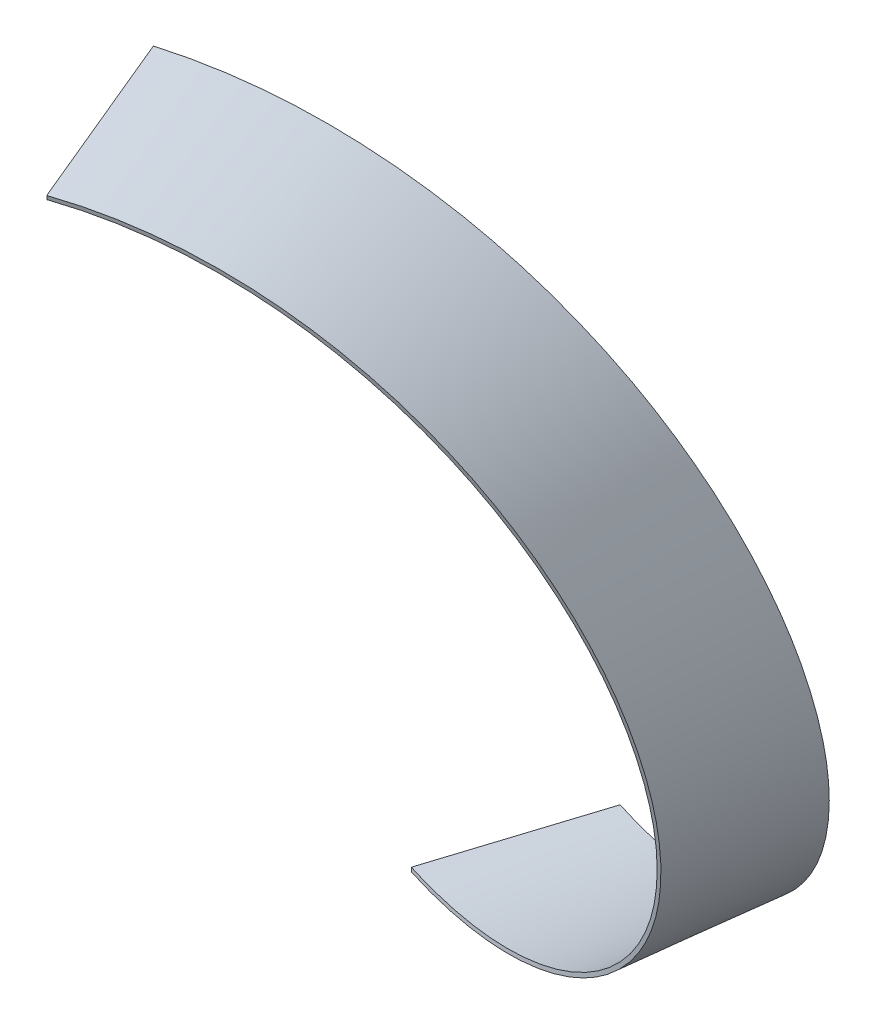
ISO-10303-21;
HEADER;
FILE_DESCRIPTION(('STEP AP214'),'2;1');
FILE_NAME('part.step','',(''),(''),'','','');
FILE_SCHEMA(('AUTOMOTIVE_DESIGN { 1 0 10303 214 1 1 1 1 }'));
ENDSEC;
DATA;
#1=APPLICATION_CONTEXT('core data for automotive mechanical design processes');
#2=APPLICATION_PROTOCOL_DEFINITION('international standard','automotive_design',2000,#1);
#3=PRODUCT_CONTEXT('',#1,'mechanical');
#4=PRODUCT('Part','Part','',(#3));
#5=PRODUCT_RELATED_PRODUCT_CATEGORY('part','',(#4));
#6=PRODUCT_DEFINITION_FORMATION('','',#4);
#7=PRODUCT_DEFINITION_CONTEXT('part definition',#1,'design');
#8=PRODUCT_DEFINITION('design','',#6,#7);
#9=PRODUCT_DEFINITION_SHAPE('','',#8);
#10=(LENGTH_UNIT() NAMED_UNIT(*) SI_UNIT(.MILLI.,.METRE.));
#11=(NAMED_UNIT(*) PLANE_ANGLE_UNIT() SI_UNIT($,.RADIAN.));
#12=(NAMED_UNIT(*) SI_UNIT($,.STERADIAN.) SOLID_ANGLE_UNIT());
#13=UNCERTAINTY_MEASURE_WITH_UNIT(LENGTH_MEASURE(1.E-05),#10,'distance_accuracy_value','');
#14=(GEOMETRIC_REPRESENTATION_CONTEXT(3) GLOBAL_UNCERTAINTY_ASSIGNED_CONTEXT((#13)) GLOBAL_UNIT_ASSIGNED_CONTEXT((#10,
#11,#12)) REPRESENTATION_CONTEXT('',''));
#15=CARTESIAN_POINT('',(0.,0.,0.));
#16=DIRECTION('',(0.,0.,1.));
#17=DIRECTION('',(1.,0.,0.));
#18=AXIS2_PLACEMENT_3D('',#15,#16,#17);
#19=CARTESIAN_POINT('',(-2.99485473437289,51.5839301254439,40.5913863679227));
#20=CARTESIAN_POINT('',(-0.998284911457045,50.5279767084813,46.8637954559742));
#21=CARTESIAN_POINT('',(0.998284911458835,49.4720232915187,53.1362045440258));
#22=CARTESIAN_POINT('',(2.99485473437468,48.4160698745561,59.4086136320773));
#23=CARTESIAN_POINT('',(-3.02248953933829,51.0902562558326,40.5170733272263));
#24=CARTESIAN_POINT('',(-1.02359311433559,50.0342845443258,46.7887387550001));
#25=CARTESIAN_POINT('',(0.975461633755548,48.9783289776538,53.060356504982));
#26=CARTESIAN_POINT('',(2.97471118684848,47.9223981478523,59.3319164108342));
#27=B_SPLINE_SURFACE_WITH_KNOTS('',1,3,((#19,#20,#21,#22),(#23,#24,#25,#26)),.UNSPECIFIED.,.F.,
.F.,.F.,(2,2),(4,4),(0.,1.),(-0.0099999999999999,0.0100000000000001),.UNSPECIFIED.);
#28=CARTESIAN_POINT('',(-3.02248953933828,51.0902562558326,40.5170733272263));
#29=CARTESIAN_POINT('',(-2.99485473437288,51.5839301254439,40.5913863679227));
#30=B_SPLINE_CURVE_WITH_KNOTS('',1,(#28,#29),.UNSPECIFIED.,.F.,.F.,(2,2),(0.,1.),.UNSPECIFIED.);
#31=CARTESIAN_POINT('',(-3.02248953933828,51.0902562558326,40.5170733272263));
#32=VERTEX_POINT('',#31);
#33=CARTESIAN_POINT('',(-2.99485473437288,51.5839301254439,40.5913863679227));
#34=VERTEX_POINT('',#33);
#35=EDGE_CURVE('E13',#32,#34,#30,.T.);
#36=CARTESIAN_POINT('',(-3.02248953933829,51.0902562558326,40.5170733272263));
#37=CARTESIAN_POINT('',(-1.02359311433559,50.0342845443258,46.7887387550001));
#38=CARTESIAN_POINT('',(0.975461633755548,48.9783289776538,53.060356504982));
#39=CARTESIAN_POINT('',(2.97471118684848,47.9223981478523,59.3319164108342));
#40=B_SPLINE_CURVE_WITH_KNOTS('',3,(#36,#37,#38,#39),.UNSPECIFIED.,.F.,.F.,(4,4),
(-0.0099999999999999,0.0100000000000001),.UNSPECIFIED.);
#41=CARTESIAN_POINT('',(2.97471118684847,47.9223981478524,59.3319164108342));
#42=VERTEX_POINT('',#41);
#43=EDGE_CURVE('E121',#32,#42,#40,.T.);
#44=CARTESIAN_POINT('',(2.97471118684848,47.9223981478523,59.3319164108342));
#45=CARTESIAN_POINT('',(2.99485473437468,48.4160698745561,59.4086136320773));
#46=B_SPLINE_CURVE_WITH_KNOTS('',1,(#44,#45),.UNSPECIFIED.,.F.,.F.,(2,2),(0.,1.),.UNSPECIFIED.);
#47=CARTESIAN_POINT('',(2.99485473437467,48.4160698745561,59.4086136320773));
#48=VERTEX_POINT('',#47);
#49=EDGE_CURVE('E69',#42,#48,#46,.T.);
#50=CARTESIAN_POINT('',(-2.99485473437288,51.5839301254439,40.5913863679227));
#51=CARTESIAN_POINT('',(-2.74528350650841,51.4519359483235,41.3754375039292));
#52=CARTESIAN_POINT('',(-2.24614105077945,51.1879475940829,42.943539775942));
#53=CARTESIAN_POINT('',(-1.49742736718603,50.7919650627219,45.2956931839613));
#54=CARTESIAN_POINT('',(-0.7487136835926,50.395982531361,47.6478465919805));
#55=CARTESIAN_POINT('',(-0.249571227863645,50.1319941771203,49.2159488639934));
#56=CARTESIAN_POINT('',(0.249571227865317,49.8680058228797,50.7840511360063));
#57=CARTESIAN_POINT('',(0.748713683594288,49.604017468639,52.3521534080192));
#58=CARTESIAN_POINT('',(1.49742736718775,49.2080349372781,54.7043068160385));
#59=CARTESIAN_POINT('',(2.24614105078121,48.8120524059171,57.0564602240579));
#60=CARTESIAN_POINT('',(2.74528350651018,48.5480640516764,58.6245624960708));
#61=CARTESIAN_POINT('',(2.99485473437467,48.4160698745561,59.4086136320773));
#62=B_SPLINE_CURVE_WITH_KNOTS('',3,(#50,#51,#52,#53,#54,#55,#56,#57,#58,#59,#60,#61),
.UNSPECIFIED.,.F.,.F.,(4,1,1,1,2,1,1,1,4),(0.,0.124999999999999,0.249999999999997,
0.374999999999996,0.499999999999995,0.624999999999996,0.749999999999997,0.874999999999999,1.),.UNSPECIFIED.);
#63=EDGE_CURVE('E256',#34,#48,#62,.T.);
#64=ORIENTED_EDGE('',*,*,#35,.F.);
#65=ORIENTED_EDGE('',*,*,#43,.T.);
#66=ORIENTED_EDGE('',*,*,#49,.T.);
#67=ORIENTED_EDGE('',*,*,#63,.F.);
#68=EDGE_LOOP('',(#64,#65,#66,#67));
#69=FACE_BOUND('',#68,.T.);
#70=ADVANCED_FACE('F55',(#69),#27,.T.);
#71=CARTESIAN_POINT('',(-3.03314471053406,-50.,9.52890513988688));
#72=CARTESIAN_POINT('',(0.360160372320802,-50.0329985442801,10.5665472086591));
#73=CARTESIAN_POINT('',(3.76168133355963,-49.7436873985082,11.6068194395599));
#74=CARTESIAN_POINT('',(10.434161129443,-48.5290174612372,13.6863320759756));
#75=CARTESIAN_POINT('',(13.7051199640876,-47.6036586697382,14.7255724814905));
#76=CARTESIAN_POINT('',(20.0015327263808,-45.1642616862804,16.8036620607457));
#77=CARTESIAN_POINT('',(23.0269866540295,-43.6502234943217,17.842511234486));
#78=CARTESIAN_POINT('',(28.7174468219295,-40.0808359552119,19.9204589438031));
#79=CARTESIAN_POINT('',(31.3824530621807,-38.0254866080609,20.95955747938));
#80=CARTESIAN_POINT('',(36.2615354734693,-33.4635190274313,23.0378630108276));
#81=CARTESIAN_POINT('',(38.4756116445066,-30.9569007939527,24.0770700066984));
#82=CARTESIAN_POINT('',(42.3623515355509,-25.582437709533,26.1554515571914));
#83=CARTESIAN_POINT('',(44.0350152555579,-22.7145928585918,27.1946261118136));
#84=CARTESIAN_POINT('',(46.7905429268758,-16.7346203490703,29.2729597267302));
#85=CARTESIAN_POINT('',(47.8734068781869,-13.62249269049,30.3121187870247));
#86=CARTESIAN_POINT('',(49.4009476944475,-7.2708983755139,32.3904383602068));
#87=CARTESIAN_POINT('',(49.8456245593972,-4.03143171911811,33.4295988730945));
#88=CARTESIAN_POINT('',(50.096791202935,2.44750159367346,35.5079198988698));
#89=CARTESIAN_POINT('',(49.9032809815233,5.68696825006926,36.5470804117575));
#90=CARTESIAN_POINT('',(48.8780734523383,12.0385625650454,38.6253999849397));
#91=CARTESIAN_POINT('',(48.0463761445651,15.1506902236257,39.6645590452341));
#92=CARTESIAN_POINT('',(45.7931817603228,21.1306627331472,41.7428926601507));
#93=CARTESIAN_POINT('',(44.3716846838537,23.9985075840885,42.7820672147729));
#94=CARTESIAN_POINT('',(40.9872780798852,29.3729706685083,44.8604487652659));
#95=CARTESIAN_POINT('',(39.0243685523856,31.8795889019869,45.8996557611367));
#96=CARTESIAN_POINT('',(34.6476194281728,36.4415564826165,47.9779612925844));
#97=CARTESIAN_POINT('',(32.2337798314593,38.4969058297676,49.0170598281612));
#98=CARTESIAN_POINT('',(27.0456529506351,42.0662933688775,51.0950075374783));
#99=CARTESIAN_POINT('',(24.2713656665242,43.5803315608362,52.1338567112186));
#100=CARTESIAN_POINT('',(18.4772861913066,46.0197285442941,54.2119462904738));
#101=CARTESIAN_POINT('',(15.4574940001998,46.9450873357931,55.2511866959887));
#102=CARTESIAN_POINT('',(9.2873474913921,48.1597572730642,57.3306993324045));
#103=CARTESIAN_POINT('',(6.13699317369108,48.4490684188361,58.3709715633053));
#104=CARTESIAN_POINT('',(2.99485473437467,48.4160698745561,59.4086136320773));
#105=CARTESIAN_POINT('',(-3.02871389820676,-49.5000216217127,9.53031551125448));
#106=CARTESIAN_POINT('',(0.335269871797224,-49.5327387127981,10.5602976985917));
#107=CARTESIAN_POINT('',(3.70743367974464,-49.2458565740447,11.5940511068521));
#108=CARTESIAN_POINT('',(10.3204846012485,-48.0417282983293,13.6624933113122));
#109=CARTESIAN_POINT('',(13.5623574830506,-47.1243215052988,14.6974619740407));
#110=CARTESIAN_POINT('',(19.8017633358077,-44.7061782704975,16.769206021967));
#111=CARTESIAN_POINT('',(22.7992750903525,-43.2054480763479,17.8059793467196));
#112=CARTESIAN_POINT('',(28.4351749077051,-39.668730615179,19.8816766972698));
#113=CARTESIAN_POINT('',(31.0745586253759,-37.6321358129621,20.9208172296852));
#114=CARTESIAN_POINT('',(35.9057853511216,-33.1126518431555,23.0010023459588));
#115=CARTESIAN_POINT('',(38.0976110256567,-30.6297789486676,24.0420482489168));
#116=CARTESIAN_POINT('',(41.9438862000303,-25.3083907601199,26.1253729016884));
#117=CARTESIAN_POINT('',(43.5990790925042,-22.4688943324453,27.1677888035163));
#118=CARTESIAN_POINT('',(46.3254660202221,-16.5490148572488,29.2534042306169));
#119=CARTESIAN_POINT('',(47.3966516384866,-13.4686514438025,30.2966054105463));
#120=CARTESIAN_POINT('',(48.9074121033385,-7.18388651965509,32.3830282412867));
#121=CARTESIAN_POINT('',(49.3472931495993,-3.97825952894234,33.4263450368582));
#122=CARTESIAN_POINT('',(49.59585922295,2.43268650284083,35.5123614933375));
#123=CARTESIAN_POINT('',(49.4045401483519,5.63798406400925,36.5550625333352));
#124=CARTESIAN_POINT('',(48.3909587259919,11.9213487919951,38.6390292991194));
#125=CARTESIAN_POINT('',(47.5684846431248,15.0006704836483,39.6804150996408));
#126=CARTESIAN_POINT('',(45.3398447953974,20.917868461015,41.7613809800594));
#127=CARTESIAN_POINT('',(43.933683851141,23.7557192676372,42.8009622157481));
#128=CARTESIAN_POINT('',(40.5860028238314,29.0732586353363,44.8777341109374));
#129=CARTESIAN_POINT('',(38.6437950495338,31.5540142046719,45.9151260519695));
#130=CARTESIAN_POINT('',(34.3125202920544,36.0691416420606,47.9874565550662));
#131=CARTESIAN_POINT('',(31.9234719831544,38.1034926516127,49.0223929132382));
#132=CARTESIAN_POINT('',(26.7890665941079,41.6359160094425,51.0893417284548));
#133=CARTESIAN_POINT('',(24.0427032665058,43.1346855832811,52.1216462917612));
#134=CARTESIAN_POINT('',(18.3061931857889,45.5496085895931,54.1845540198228));
#135=CARTESIAN_POINT('',(15.3160692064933,46.4657556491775,55.2151513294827));
#136=CARTESIAN_POINT('',(9.20686183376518,47.6683143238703,57.2753434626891));
#137=CARTESIAN_POINT('',(6.0867201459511,47.9549182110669,58.3052672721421));
#138=CARTESIAN_POINT('',(2.97471118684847,47.9223981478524,59.3319164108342));
#139=B_SPLINE_SURFACE_WITH_KNOTS('',1,3,((#71,#72,#73,#74,#75,#76,#77,#78,#79,#80,#81,#82,#83,
#84,#85,#86,#87,#88,#89,#90,#91,#92,#93,#94,#95,#96,#97,#98,#99,#100,#101,#102,#103,#104),(#105,
#106,#107,#108,#109,#110,#111,#112,#113,#114,#115,#116,#117,#118,#119,#120,#121,#122,#123,#124,
#125,#126,#127,#128,#129,#130,#131,#132,#133,#134,#135,#136,#137,#138)),.UNSPECIFIED.,.F.,.F.,
.F.,(2,2),(4,2,2,2,2,2,2,2,2,2,2,2,2,2,2,2,4),(0.,1.),(0.,0.0625,0.125,0.1875,0.25,0.3125,0.375,
0.4375,0.5,0.5625,0.625,0.6875,0.75,0.8125,0.875,0.9375,1.),.UNSPECIFIED.);
#140=CARTESIAN_POINT('',(2.97471118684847,47.9223981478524,59.3319164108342));
#141=CARTESIAN_POINT('',(6.0867201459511,47.9549182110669,58.3052672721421));
#142=CARTESIAN_POINT('',(9.20686183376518,47.6683143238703,57.2753434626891));
#143=CARTESIAN_POINT('',(15.3160692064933,46.4657556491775,55.2151513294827));
#144=CARTESIAN_POINT('',(18.3061931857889,45.5496085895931,54.1845540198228));
#145=CARTESIAN_POINT('',(24.0427032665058,43.1346855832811,52.1216462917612));
#146=CARTESIAN_POINT('',(26.7890665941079,41.6359160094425,51.0893417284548));
#147=CARTESIAN_POINT('',(31.9234719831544,38.1034926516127,49.0223929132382));
#148=CARTESIAN_POINT('',(34.3125202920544,36.0691416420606,47.9874565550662));
#149=CARTESIAN_POINT('',(38.6437950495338,31.5540142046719,45.9151260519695));
#150=CARTESIAN_POINT('',(40.5860028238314,29.0732586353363,44.8777341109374));
#151=CARTESIAN_POINT('',(43.933683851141,23.7557192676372,42.8009622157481));
#152=CARTESIAN_POINT('',(45.3398447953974,20.917868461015,41.7613809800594));
#153=CARTESIAN_POINT('',(47.5684846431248,15.0006704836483,39.6804150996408));
#154=CARTESIAN_POINT('',(48.3909587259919,11.9213487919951,38.6390292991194));
#155=CARTESIAN_POINT('',(49.4045401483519,5.63798406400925,36.5550625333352));
#156=CARTESIAN_POINT('',(49.59585922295,2.43268650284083,35.5123614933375));
#157=CARTESIAN_POINT('',(49.3472931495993,-3.97825952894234,33.4263450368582));
#158=CARTESIAN_POINT('',(48.9074121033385,-7.18388651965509,32.3830282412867));
#159=CARTESIAN_POINT('',(47.3966516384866,-13.4686514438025,30.2966054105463));
#160=CARTESIAN_POINT('',(46.3254660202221,-16.5490148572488,29.2534042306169));
#161=CARTESIAN_POINT('',(43.5990790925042,-22.4688943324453,27.1677888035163));
#162=CARTESIAN_POINT('',(41.9438862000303,-25.3083907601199,26.1253729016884));
#163=CARTESIAN_POINT('',(38.0976110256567,-30.6297789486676,24.0420482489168));
#164=CARTESIAN_POINT('',(35.9057853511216,-33.1126518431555,23.0010023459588));
#165=CARTESIAN_POINT('',(31.0745586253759,-37.6321358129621,20.9208172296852));
#166=CARTESIAN_POINT('',(28.4351749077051,-39.668730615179,19.8816766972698));
#167=CARTESIAN_POINT('',(22.7992750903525,-43.2054480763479,17.8059793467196));
#168=CARTESIAN_POINT('',(19.8017633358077,-44.7061782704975,16.769206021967));
#169=CARTESIAN_POINT('',(13.5623574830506,-47.1243215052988,14.6974619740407));
#170=CARTESIAN_POINT('',(10.3204846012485,-48.0417282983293,13.6624933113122));
#171=CARTESIAN_POINT('',(3.70743367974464,-49.2458565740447,11.5940511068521));
#172=CARTESIAN_POINT('',(0.335269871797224,-49.5327387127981,10.5602976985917));
#173=CARTESIAN_POINT('',(-3.02871389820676,-49.5000216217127,9.53031551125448));
#174=B_SPLINE_CURVE_WITH_KNOTS('',3,(#140,#141,#142,#143,#144,#145,#146,#147,#148,#149,#150,
#151,#152,#153,#154,#155,#156,#157,#158,#159,#160,#161,#162,#163,#164,#165,#166,#167,#168,#169,
#170,#171,#172,#173),.UNSPECIFIED.,.F.,.F.,(4,2,2,2,2,2,2,2,2,2,2,2,2,2,2,2,4),(0.,0.0625,0.125,
0.1875,0.25,0.3125,0.375,0.4375,0.5,0.5625,0.625,0.6875,0.75,0.8125,0.875,0.9375,1.),.UNSPECIFIED.);
#175=CARTESIAN_POINT('',(-3.02871389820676,-49.5000216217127,9.53031551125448));
#176=VERTEX_POINT('',#175);
#177=EDGE_CURVE('E289',#42,#176,#174,.T.);
#178=CARTESIAN_POINT('',(-3.02871389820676,-49.5000216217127,9.53031551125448));
#179=CARTESIAN_POINT('',(-3.03314471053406,-50.,9.52890513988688));
#180=B_SPLINE_CURVE_WITH_KNOTS('',1,(#178,#179),.UNSPECIFIED.,.F.,.F.,(2,2),(0.,1.),.UNSPECIFIED.);
#181=CARTESIAN_POINT('',(-3.03314471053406,-50.,9.52890513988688));
#182=VERTEX_POINT('',#181);
#183=EDGE_CURVE('E111',#176,#182,#180,.T.);
#184=CARTESIAN_POINT('',(2.99485473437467,48.4160698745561,59.4086136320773));
#185=CARTESIAN_POINT('',(6.13699317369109,48.4490684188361,58.3709715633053));
#186=CARTESIAN_POINT('',(15.5880561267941,47.5811349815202,55.2501548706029));
#187=CARTESIAN_POINT('',(30.3606117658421,41.3642219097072,50.0565324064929));
#188=CARTESIAN_POINT('',(43.7623062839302,27.4081923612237,43.8211931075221));
#189=CARTESIAN_POINT('',(50.6670513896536,9.11744340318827,37.586243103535));
#190=CARTESIAN_POINT('',(49.91355145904,-10.7013735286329,31.3512756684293));
#191=CARTESIAN_POINT('',(41.5018064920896,-28.9921224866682,25.1163256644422));
#192=CARTESIAN_POINT('',(26.5931121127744,-42.9481520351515,18.8809863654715));
#193=CARTESIAN_POINT('',(10.5647232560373,-49.1650651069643,13.6873639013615));
#194=CARTESIAN_POINT('',(0.360160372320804,-50.0329985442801,10.5665472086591));
#195=CARTESIAN_POINT('',(-3.03314471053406,-50.,9.52890513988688));
#196=B_SPLINE_CURVE_WITH_KNOTS('',3,(#184,#185,#186,#187,#188,#189,#190,#191,#192,#193,#194,
#195),.UNSPECIFIED.,.F.,.F.,(4,1,1,1,1,1,1,1,1,4),(0.,0.0625,0.1875,0.3125,0.4375,0.5625,0.6875,
0.8125,0.9375,1.),.UNSPECIFIED.);
#197=EDGE_CURVE('E129',#48,#182,#196,.T.);
#198=ORIENTED_EDGE('',*,*,#49,.F.);
#199=ORIENTED_EDGE('',*,*,#177,.T.);
#200=ORIENTED_EDGE('',*,*,#183,.T.);
#201=ORIENTED_EDGE('',*,*,#197,.F.);
#202=EDGE_LOOP('',(#198,#199,#200,#201));
#203=FACE_BOUND('',#202,.T.);
#204=ADVANCED_FACE('F152',(#203),#139,.F.);
#205=CARTESIAN_POINT('',(-3.03314471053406,-49.9999999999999,9.52890513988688));
#206=CARTESIAN_POINT('',(-1.01104823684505,-50.,3.17630171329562));
#207=CARTESIAN_POINT('',(1.01104823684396,-50.,-3.17630171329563));
#208=CARTESIAN_POINT('',(3.03314471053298,-50.0000000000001,-9.52890513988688));
#209=CARTESIAN_POINT('',(-3.02871389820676,-49.5000216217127,9.53031551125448));
#210=CARTESIAN_POINT('',(-1.0094720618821,-49.4999937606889,3.17680342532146));
#211=CARTESIAN_POINT('',(1.0095786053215,-49.4999905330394,-3.17676951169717));
#212=CARTESIAN_POINT('',(3.02839562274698,-49.5000248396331,-9.53041682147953));
#213=B_SPLINE_SURFACE_WITH_KNOTS('',1,3,((#205,#206,#207,#208),(#209,#210,#211,#212)),
.UNSPECIFIED.,.F.,.F.,.F.,(2,2),(4,4),(0.,1.),(-0.0099999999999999,0.0100000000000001),.UNSPECIFIED.);
#214=CARTESIAN_POINT('',(-3.02871389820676,-49.5000216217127,9.53031551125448));
#215=CARTESIAN_POINT('',(-1.0094720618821,-49.4999937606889,3.17680342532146));
#216=CARTESIAN_POINT('',(1.0095786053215,-49.4999905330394,-3.17676951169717));
#217=CARTESIAN_POINT('',(3.02839562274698,-49.5000248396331,-9.53041682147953));
#218=B_SPLINE_CURVE_WITH_KNOTS('',3,(#214,#215,#216,#217),.UNSPECIFIED.,.F.,.F.,(4,4),
(-0.0099999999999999,0.0100000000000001),.UNSPECIFIED.);
#219=CARTESIAN_POINT('',(3.02839562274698,-49.5000248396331,-9.53041682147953));
#220=VERTEX_POINT('',#219);
#221=EDGE_CURVE('E119',#176,#220,#218,.T.);
#222=CARTESIAN_POINT('',(3.02839562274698,-49.5000248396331,-9.53041682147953));
#223=CARTESIAN_POINT('',(3.03314471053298,-50.0000000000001,-9.52890513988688));
#224=B_SPLINE_CURVE_WITH_KNOTS('',1,(#222,#223),.UNSPECIFIED.,.F.,.F.,(2,2),(0.,1.),.UNSPECIFIED.);
#225=CARTESIAN_POINT('',(3.03314471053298,-50.,-9.52890513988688));
#226=VERTEX_POINT('',#225);
#227=EDGE_CURVE('E99',#220,#226,#224,.T.);
#228=CARTESIAN_POINT('',(-3.03314471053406,-50.,9.52890513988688));
#229=CARTESIAN_POINT('',(-2.78038265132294,-50.,8.73482971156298));
#230=CARTESIAN_POINT('',(-2.27485853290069,-49.9999999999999,7.14667885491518));
#231=CARTESIAN_POINT('',(-1.51657235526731,-50.0000000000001,4.76445256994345));
#232=CARTESIAN_POINT('',(-0.758286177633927,-50.,2.38222628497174));
#233=CARTESIAN_POINT('',(-0.25276205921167,-50.,0.794075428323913));
#234=CARTESIAN_POINT('',(0.252762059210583,-50.,-0.794075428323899));
#235=CARTESIAN_POINT('',(0.758286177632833,-50.,-2.3822262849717));
#236=CARTESIAN_POINT('',(1.51657235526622,-50.,-4.76445256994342));
#237=CARTESIAN_POINT('',(2.2748585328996,-50.,-7.14667885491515));
#238=CARTESIAN_POINT('',(2.78038265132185,-50.,-8.73482971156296));
#239=CARTESIAN_POINT('',(3.03314471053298,-50.,-9.52890513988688));
#240=B_SPLINE_CURVE_WITH_KNOTS('',3,(#228,#229,#230,#231,#232,#233,#234,#235,#236,#237,#238,
#239),.UNSPECIFIED.,.F.,.F.,(4,1,1,1,2,1,1,1,4),(0.,0.125000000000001,0.250000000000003,
0.375000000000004,0.500000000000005,0.625000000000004,0.750000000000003,0.875000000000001,1.),.UNSPECIFIED.);
#241=EDGE_CURVE('E112',#182,#226,#240,.T.);
#242=ORIENTED_EDGE('',*,*,#183,.F.);
#243=ORIENTED_EDGE('',*,*,#221,.T.);
#244=ORIENTED_EDGE('',*,*,#227,.T.);
#245=ORIENTED_EDGE('',*,*,#241,.F.);
#246=EDGE_LOOP('',(#242,#243,#244,#245));
#247=FACE_BOUND('',#246,.T.);
#248=ADVANCED_FACE('F126',(#247),#213,.T.);
#249=CARTESIAN_POINT('',(3.03314471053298,-50.,-9.52890513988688));
#250=CARTESIAN_POINT('',(6.17528314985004,-49.96700145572,-8.48625092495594));
#251=CARTESIAN_POINT('',(9.32563746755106,-49.6116932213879,-7.44096654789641));
#252=CARTESIAN_POINT('',(15.4957839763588,-48.2650291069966,-5.35142961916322));
#253=CARTESIAN_POINT('',(18.5155761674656,-47.2736732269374,-4.30717706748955));
#254=CARTESIAN_POINT('',(24.3096556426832,-44.7022820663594,-2.21906319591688));
#255=CARTESIAN_POINT('',(27.0839429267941,-43.1222467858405,-1.17520187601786));
#256=CARTESIAN_POINT('',(32.2720698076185,-39.4208650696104,0.912770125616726));
#257=CARTESIAN_POINT('',(34.6859094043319,-37.2995186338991,1.9568808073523));
#258=CARTESIAN_POINT('',(39.0626585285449,-32.6055568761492,4.04521063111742));
#259=CARTESIAN_POINT('',(41.0255680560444,-30.0329415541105,5.08942977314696));
#260=CARTESIAN_POINT('',(44.4099746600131,-24.5264842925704,7.1778356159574));
#261=CARTESIAN_POINT('',(45.8314717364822,-21.5926423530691,8.2220223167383));
#262=CARTESIAN_POINT('',(48.0846661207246,-15.4806756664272,10.3103802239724));
#263=CARTESIAN_POINT('',(48.9163634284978,-12.3025509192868,11.3545514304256));
#264=CARTESIAN_POINT('',(49.9415709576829,-5.81896242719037,13.4428952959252));
#265=CARTESIAN_POINT('',(50.1350811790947,-2.51349868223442,14.4870679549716));
#266=CARTESIAN_POINT('',(49.883914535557,4.09742880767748,16.5754132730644));
#267=CARTESIAN_POINT('',(49.4392376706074,7.40289255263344,17.6195859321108));
#268=CARTESIAN_POINT('',(47.9116968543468,13.8864810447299,19.7079297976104));
#269=CARTESIAN_POINT('',(46.8288329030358,17.0646057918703,20.7521010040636));
#270=CARTESIAN_POINT('',(44.0733052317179,23.1765724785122,22.8404589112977));
#271=CARTESIAN_POINT('',(42.400641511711,26.1104144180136,23.8846456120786));
#272=CARTESIAN_POINT('',(38.5139016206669,31.6168716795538,25.9730514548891));
#273=CARTESIAN_POINT('',(36.2998254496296,34.1894870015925,27.0172705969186));
#274=CARTESIAN_POINT('',(31.4207430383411,38.8834487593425,29.1056004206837));
#275=CARTESIAN_POINT('',(28.7557367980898,41.0047951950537,30.1497111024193));
#276=CARTESIAN_POINT('',(23.0652766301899,44.7061769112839,32.2376831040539));
#277=CARTESIAN_POINT('',(20.0398227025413,46.2862121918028,33.2815444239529));
#278=CARTESIAN_POINT('',(13.743409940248,48.857603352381,35.3696582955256));
#279=CARTESIAN_POINT('',(10.4724511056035,49.8489592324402,36.4139108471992));
#280=CARTESIAN_POINT('',(3.79997130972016,51.1956233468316,38.5034477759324));
#281=CARTESIAN_POINT('',(0.398450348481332,51.5509315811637,39.548732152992));
#282=CARTESIAN_POINT('',(-2.99485473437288,51.5839301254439,40.5913863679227));
#283=CARTESIAN_POINT('',(3.02839562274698,-49.5000248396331,-9.53041682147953));
#284=CARTESIAN_POINT('',(6.13908528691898,-49.4673498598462,-8.49597942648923));
#285=CARTESIAN_POINT('',(9.25803643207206,-49.115478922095,-7.45766651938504));
#286=CARTESIAN_POINT('',(15.3649928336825,-47.7821621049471,-5.37989987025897));
#287=CARTESIAN_POINT('',(18.3540660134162,-46.8005067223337,-4.34014310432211));
#288=CARTESIAN_POINT('',(24.0885391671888,-44.2543956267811,-2.25861154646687));
#289=CARTESIAN_POINT('',(26.8339153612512,-42.6899511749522,-1.21683917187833));
#290=CARTESIAN_POINT('',(31.9664418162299,-39.0261446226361,0.869018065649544));
#291=CARTESIAN_POINT('',(34.354600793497,-36.9260833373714,1.91332341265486));
#292=CARTESIAN_POINT('',(38.6843274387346,-32.279556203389,4.00391037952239));
#293=CARTESIAN_POINT('',(40.6258802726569,-29.7331118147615,5.05019338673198));
#294=CARTESIAN_POINT('',(43.9725989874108,-24.2841126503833,7.14398005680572));
#295=CARTESIAN_POINT('',(45.3784531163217,-21.3804884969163,8.19161704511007));
#296=CARTESIAN_POINT('',(47.6067784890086,-15.3314676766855,10.2875767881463));
#297=CARTESIAN_POINT('',(48.429244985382,-12.1860917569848,11.3359010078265));
#298=CARTESIAN_POINT('',(49.4428679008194,-5.77016685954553,13.4324451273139));
#299=CARTESIAN_POINT('',(49.6342254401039,-2.49837726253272,14.4807570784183));
#300=CARTESIAN_POINT('',(49.3854446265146,4.04593952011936,16.5766618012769));
#301=CARTESIAN_POINT('',(48.9453059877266,7.31844538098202,17.6242563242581));
#302=CARTESIAN_POINT('',(47.4334529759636,13.7371382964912,19.7179886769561));
#303=CARTESIAN_POINT('',(46.3614456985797,16.8845157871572,20.764245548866));
#304=CARTESIAN_POINT('',(43.6328338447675,22.9382373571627,22.8550200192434));
#305=CARTESIAN_POINT('',(41.9762379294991,25.8445598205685,23.8995389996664));
#306=CARTESIAN_POINT('',(38.1267184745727,31.2991748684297,25.9863491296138));
#307=CARTESIAN_POINT('',(35.9330975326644,33.8484345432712,27.0288327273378));
#308=CARTESIAN_POINT('',(31.0981739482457,38.5002337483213,29.111538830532));
#309=CARTESIAN_POINT('',(28.4568889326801,40.6027583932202,30.1517596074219));
#310=CARTESIAN_POINT('',(22.8172985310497,44.2709898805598,32.2295011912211));
#311=CARTESIAN_POINT('',(19.8180397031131,45.8373204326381,33.2672943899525));
#312=CARTESIAN_POINT('',(13.5753889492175,48.3865821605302,35.3413288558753));
#313=CARTESIAN_POINT('',(10.3320157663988,49.3695090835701,36.3775653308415));
#314=CARTESIAN_POINT('',(3.71618003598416,50.7047639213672,38.4491193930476));
#315=CARTESIAN_POINT('',(0.342735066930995,51.0572755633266,39.4847428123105));
#316=CARTESIAN_POINT('',(-3.02248953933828,51.0902562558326,40.5170733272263));
#317=B_SPLINE_SURFACE_WITH_KNOTS('',1,3,((#249,#250,#251,#252,#253,#254,#255,#256,#257,#258,
#259,#260,#261,#262,#263,#264,#265,#266,#267,#268,#269,#270,#271,#272,#273,#274,#275,#276,#277,
#278,#279,#280,#281,#282),(#283,#284,#285,#286,#287,#288,#289,#290,#291,#292,#293,#294,#295,
#296,#297,#298,#299,#300,#301,#302,#303,#304,#305,#306,#307,#308,#309,#310,#311,#312,#313,#314,
#315,#316)),.UNSPECIFIED.,.F.,.F.,.F.,(2,2),(4,2,2,2,2,2,2,2,2,2,2,2,2,2,2,2,4),(0.,1.),(0.,
0.0625,0.125,0.1875,0.25,0.3125,0.375,0.4375,0.5,0.5625,0.625,0.6875,0.75,0.8125,0.875,0.9375,
1.),.UNSPECIFIED.);
#318=CARTESIAN_POINT('',(3.02839562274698,-49.5000248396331,-9.53041682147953));
#319=CARTESIAN_POINT('',(6.13908528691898,-49.4673498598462,-8.49597942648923));
#320=CARTESIAN_POINT('',(9.25803643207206,-49.115478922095,-7.45766651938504));
#321=CARTESIAN_POINT('',(15.3649928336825,-47.7821621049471,-5.37989987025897));
#322=CARTESIAN_POINT('',(18.3540660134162,-46.8005067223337,-4.34014310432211));
#323=CARTESIAN_POINT('',(24.0885391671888,-44.2543956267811,-2.25861154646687));
#324=CARTESIAN_POINT('',(26.8339153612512,-42.6899511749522,-1.21683917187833));
#325=CARTESIAN_POINT('',(31.9664418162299,-39.0261446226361,0.869018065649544));
#326=CARTESIAN_POINT('',(34.354600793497,-36.9260833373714,1.91332341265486));
#327=CARTESIAN_POINT('',(38.6843274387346,-32.279556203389,4.00391037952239));
#328=CARTESIAN_POINT('',(40.6258802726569,-29.7331118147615,5.05019338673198));
#329=CARTESIAN_POINT('',(43.9725989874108,-24.2841126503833,7.14398005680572));
#330=CARTESIAN_POINT('',(45.3784531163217,-21.3804884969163,8.19161704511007));
#331=CARTESIAN_POINT('',(47.6067784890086,-15.3314676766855,10.2875767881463));
#332=CARTESIAN_POINT('',(48.429244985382,-12.1860917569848,11.3359010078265));
#333=CARTESIAN_POINT('',(49.4428679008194,-5.77016685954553,13.4324451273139));
#334=CARTESIAN_POINT('',(49.6342254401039,-2.49837726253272,14.4807570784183));
#335=CARTESIAN_POINT('',(49.3854446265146,4.04593952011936,16.5766618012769));
#336=CARTESIAN_POINT('',(48.9453059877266,7.31844538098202,17.6242563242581));
#337=CARTESIAN_POINT('',(47.4334529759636,13.7371382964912,19.7179886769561));
#338=CARTESIAN_POINT('',(46.3614456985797,16.8845157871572,20.764245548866));
#339=CARTESIAN_POINT('',(43.6328338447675,22.9382373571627,22.8550200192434));
#340=CARTESIAN_POINT('',(41.9762379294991,25.8445598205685,23.8995389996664));
#341=CARTESIAN_POINT('',(38.1267184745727,31.2991748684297,25.9863491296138));
#342=CARTESIAN_POINT('',(35.9330975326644,33.8484345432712,27.0288327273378));
#343=CARTESIAN_POINT('',(31.0981739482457,38.5002337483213,29.111538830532));
#344=CARTESIAN_POINT('',(28.4568889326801,40.6027583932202,30.1517596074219));
#345=CARTESIAN_POINT('',(22.8172985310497,44.2709898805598,32.2295011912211));
#346=CARTESIAN_POINT('',(19.8180397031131,45.8373204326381,33.2672943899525));
#347=CARTESIAN_POINT('',(13.5753889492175,48.3865821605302,35.3413288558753));
#348=CARTESIAN_POINT('',(10.3320157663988,49.3695090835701,36.3775653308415));
#349=CARTESIAN_POINT('',(3.71618003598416,50.7047639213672,38.4491193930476));
#350=CARTESIAN_POINT('',(0.342735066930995,51.0572755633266,39.4847428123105));
#351=CARTESIAN_POINT('',(-3.02248953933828,51.0902562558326,40.5170733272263));
#352=B_SPLINE_CURVE_WITH_KNOTS('',3,(#318,#319,#320,#321,#322,#323,#324,#325,#326,#327,#328,
#329,#330,#331,#332,#333,#334,#335,#336,#337,#338,#339,#340,#341,#342,#343,#344,#345,#346,#347,
#348,#349,#350,#351),.UNSPECIFIED.,.F.,.F.,(4,2,2,2,2,2,2,2,2,2,2,2,2,2,2,2,4),(0.,0.0625,0.125,
0.1875,0.25,0.3125,0.375,0.4375,0.5,0.5625,0.625,0.6875,0.75,0.8125,0.875,0.9375,1.),.UNSPECIFIED.);
#353=EDGE_CURVE('E101',#220,#32,#352,.T.);
#354=CARTESIAN_POINT('',(3.03314471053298,-50.,-9.52890513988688));
#355=CARTESIAN_POINT('',(6.17528314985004,-49.96700145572,-8.48625092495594));
#356=CARTESIAN_POINT('',(15.6263461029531,-48.9010767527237,-5.35039779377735));
#357=CARTESIAN_POINT('',(30.3989017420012,-42.3541782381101,-0.131714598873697));
#358=CARTESIAN_POINT('',(43.8005962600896,-28.0021661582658,6.13369757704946));
#359=CARTESIAN_POINT('',(50.7053413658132,-9.31543466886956,12.3987204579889));
#360=CARTESIAN_POINT('',(49.9518414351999,10.8993647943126,18.6637607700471));
#361=CARTESIAN_POINT('',(41.5400964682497,29.586096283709,24.9287836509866));
#362=CARTESIAN_POINT('',(26.6314020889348,43.9381083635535,31.1941958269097));
#363=CARTESIAN_POINT('',(10.6030132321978,50.4850068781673,36.4128790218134));
#364=CARTESIAN_POINT('',(0.398450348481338,51.5509315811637,39.548732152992));
#365=CARTESIAN_POINT('',(-2.99485473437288,51.5839301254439,40.5913863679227));
#366=B_SPLINE_CURVE_WITH_KNOTS('',3,(#354,#355,#356,#357,#358,#359,#360,#361,#362,#363,#364,
#365),.UNSPECIFIED.,.F.,.F.,(4,1,1,1,1,1,1,1,1,4),(0.,0.0625,0.1875,0.3125,0.4375,0.5625,0.6875,
0.8125,0.9375,1.),.UNSPECIFIED.);
#367=EDGE_CURVE('E104',#226,#34,#366,.T.);
#368=ORIENTED_EDGE('',*,*,#353,.T.);
#369=ORIENTED_EDGE('',*,*,#35,.T.);
#370=ORIENTED_EDGE('',*,*,#367,.F.);
#371=ORIENTED_EDGE('',*,*,#227,.F.);
#372=EDGE_LOOP('',(#368,#369,#370,#371));
#373=FACE_BOUND('',#372,.T.);
#374=ADVANCED_FACE('F57',(#373),#317,.T.);
#375=CARTESIAN_POINT('',(-3.03314471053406,-50.,9.52890513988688));
#376=CARTESIAN_POINT('',(0.360160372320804,-50.0329985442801,10.5665472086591));
#377=CARTESIAN_POINT('',(10.5647232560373,-49.1650651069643,13.6873639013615));
#378=CARTESIAN_POINT('',(26.5931121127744,-42.9481520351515,18.8809863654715));
#379=CARTESIAN_POINT('',(41.5018064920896,-28.9921224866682,25.1163256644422));
#380=CARTESIAN_POINT('',(49.91355145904,-10.7013735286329,31.3512756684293));
#381=CARTESIAN_POINT('',(50.6670513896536,9.11744340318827,37.586243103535));
#382=CARTESIAN_POINT('',(43.7623062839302,27.4081923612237,43.8211931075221));
#383=CARTESIAN_POINT('',(30.3606117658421,41.3642219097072,50.0565324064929));
#384=CARTESIAN_POINT('',(15.5880561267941,47.5811349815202,55.2501548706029));
#385=CARTESIAN_POINT('',(6.13699317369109,48.4490684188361,58.3709715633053));
#386=CARTESIAN_POINT('',(2.99485473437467,48.4160698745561,59.4086136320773));
#387=CARTESIAN_POINT('',(-2.78038265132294,-50.,8.73482971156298));
#388=CARTESIAN_POINT('',(0.602457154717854,-50.0302486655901,9.77268061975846));
#389=CARTESIAN_POINT('',(10.7756242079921,-49.1540655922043,12.8941238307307));
#390=CARTESIAN_POINT('',(26.7516866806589,-42.9234031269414,18.0887904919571));
#391=CARTESIAN_POINT('',(41.5975893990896,-28.9508743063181,24.3253828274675));
#392=CARTESIAN_POINT('',(49.9465427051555,-10.6436260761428,30.5615858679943));
#393=CARTESIAN_POINT('',(50.6372509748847,9.19169012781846,36.7978063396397));
#394=CARTESIAN_POINT('',(43.6697142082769,27.4989383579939,43.0340093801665));
#395=CARTESIAN_POINT('',(30.2052280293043,41.4714671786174,49.2706017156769));
#396=CARTESIAN_POINT('',(15.3803460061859,47.7021296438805,54.4652683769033));
#397=CARTESIAN_POINT('',(5.89788722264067,48.5783127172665,57.5867115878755));
#398=CARTESIAN_POINT('',(2.74528350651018,48.5480640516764,58.6245624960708));
#399=CARTESIAN_POINT('',(-2.27485853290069,-49.9999999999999,7.14667885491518));
#400=CARTESIAN_POINT('',(1.08705071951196,-50.02474890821,8.18494744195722));
#401=CARTESIAN_POINT('',(11.1974261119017,-49.1320665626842,11.3076436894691));
#402=CARTESIAN_POINT('',(27.0688358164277,-42.8739053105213,16.5043987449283));
#403=CARTESIAN_POINT('',(41.7891552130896,-28.8683779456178,22.7434971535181));
#404=CARTESIAN_POINT('',(50.0125251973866,-10.5281311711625,28.9822062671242));
#405=CARTESIAN_POINT('',(50.5776501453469,9.34018357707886,35.220932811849));
#406=CARTESIAN_POINT('',(43.4845300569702,27.6804303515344,41.4596419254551));
#407=CARTESIAN_POINT('',(29.8944605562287,41.685957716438,47.698740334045));
#408=CARTESIAN_POINT('',(14.9649257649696,47.9441189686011,52.8954953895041));
#409=CARTESIAN_POINT('',(5.41967532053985,48.8368013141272,56.0181916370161));
#410=CARTESIAN_POINT('',(2.24614105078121,48.8120524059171,57.0564602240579));
#411=CARTESIAN_POINT('',(-1.51657235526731,-50.0000000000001,4.76445256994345));
#412=CARTESIAN_POINT('',(1.81394106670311,-50.0164992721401,5.80334767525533));
#413=CARTESIAN_POINT('',(11.8301289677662,-49.0990680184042,8.92792347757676));
#414=CARTESIAN_POINT('',(27.5445595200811,-42.7996585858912,14.1278111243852));
#415=CARTESIAN_POINT('',(42.0765039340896,-28.7446334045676,20.370668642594));
#416=CARTESIAN_POINT('',(50.1114989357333,-10.3548888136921,26.6131368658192));
#417=CARTESIAN_POINT('',(50.4882489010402,9.56292375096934,32.855622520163));
#418=CARTESIAN_POINT('',(43.2067538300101,27.952668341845,39.0980907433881));
#419=CARTESIAN_POINT('',(29.4283093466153,42.0076935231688,45.340948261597));
#420=CARTESIAN_POINT('',(14.341795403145,48.307102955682,50.5408359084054));
#421=CARTESIAN_POINT('',(4.70235746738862,49.2245342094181,53.6654117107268));
#422=CARTESIAN_POINT('',(1.49742736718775,49.2080349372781,54.7043068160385));
#423=CARTESIAN_POINT('',(-0.758286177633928,-50.,2.38222628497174));
#424=CARTESIAN_POINT('',(2.54083141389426,-50.00824963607,3.42174790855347));
#425=CARTESIAN_POINT('',(12.4628318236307,-49.066069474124,6.54820326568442));
#426=CARTESIAN_POINT('',(28.0202832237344,-42.7254118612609,11.751223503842));
#427=CARTESIAN_POINT('',(42.3638526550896,-28.6208888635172,17.9978401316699));
#428=CARTESIAN_POINT('',(50.2104726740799,-10.1816464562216,24.2440674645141));
#429=CARTESIAN_POINT('',(50.3988476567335,9.78566392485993,30.490312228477));
#430=CARTESIAN_POINT('',(42.92897760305,28.2249063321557,36.7365395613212));
#431=CARTESIAN_POINT('',(28.9621581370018,42.3294293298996,42.9831561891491));
#432=CARTESIAN_POINT('',(13.7186650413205,48.6700869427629,48.1861764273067));
#433=CARTESIAN_POINT('',(3.98503961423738,49.612267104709,51.3126317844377));
#434=CARTESIAN_POINT('',(0.748713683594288,49.604017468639,52.3521534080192));
#435=CARTESIAN_POINT('',(-0.252762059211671,-50.,0.794075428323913));
#436=CARTESIAN_POINT('',(3.02542497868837,-50.0027498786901,1.8340147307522));
#437=CARTESIAN_POINT('',(12.8846337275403,-49.044070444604,4.96172312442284));
#438=CARTESIAN_POINT('',(28.3374323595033,-42.6759140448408,10.1668317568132));
#439=CARTESIAN_POINT('',(42.5554184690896,-28.5383925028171,16.4159544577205));
#440=CARTESIAN_POINT('',(50.276455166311,-10.0661515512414,22.6646878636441));
#441=CARTESIAN_POINT('',(50.3392468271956,9.93415737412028,28.9134387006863));
#442=CARTESIAN_POINT('',(42.7437934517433,28.4063983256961,35.1621721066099));
#443=CARTESIAN_POINT('',(28.6513906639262,42.5439198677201,41.4112948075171));
#444=CARTESIAN_POINT('',(13.3032448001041,48.9120762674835,46.6164034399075));
#445=CARTESIAN_POINT('',(3.50682771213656,49.8707557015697,49.7441118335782));
#446=CARTESIAN_POINT('',(0.249571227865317,49.8680058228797,50.7840511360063));
#447=CARTESIAN_POINT('',(0.252762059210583,-50.,-0.7940754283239));
#448=CARTESIAN_POINT('',(3.51001854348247,-49.99725012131,0.246281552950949));
#449=CARTESIAN_POINT('',(13.30643563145,-49.0220714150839,3.37524298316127));
#450=CARTESIAN_POINT('',(28.6545814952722,-42.6264162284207,8.58244000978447));
#451=CARTESIAN_POINT('',(42.7469842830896,-28.4558961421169,14.8340687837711));
#452=CARTESIAN_POINT('',(50.3424376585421,-9.95065664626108,21.085308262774));
#453=CARTESIAN_POINT('',(50.2796459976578,10.0826508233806,27.3365651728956));
#454=CARTESIAN_POINT('',(42.5586093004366,28.5878903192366,33.5878046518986));
#455=CARTESIAN_POINT('',(28.3406231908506,42.7584104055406,39.8394334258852));
#456=CARTESIAN_POINT('',(12.8878245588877,49.1540655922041,45.0466304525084));
#457=CARTESIAN_POINT('',(3.02861581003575,50.1292442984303,48.1755918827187));
#458=CARTESIAN_POINT('',(-0.249571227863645,50.1319941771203,49.2159488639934));
#459=CARTESIAN_POINT('',(0.758286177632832,-50.,-2.3822262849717));
#460=CARTESIAN_POINT('',(3.99461210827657,-49.9917503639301,-1.34145162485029));
#461=CARTESIAN_POINT('',(13.7282375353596,-49.0000723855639,1.78876284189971));
#462=CARTESIAN_POINT('',(28.9717306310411,-42.5769184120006,6.99804826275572));
#463=CARTESIAN_POINT('',(42.9385500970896,-28.3733997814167,13.2521831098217));
#464=CARTESIAN_POINT('',(50.4084201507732,-9.83516174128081,19.505928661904));
#465=CARTESIAN_POINT('',(50.22004516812,10.231144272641,25.759691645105));
#466=CARTESIAN_POINT('',(42.3734251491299,28.769382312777,32.0134371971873));
#467=CARTESIAN_POINT('',(28.029855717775,42.9729009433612,38.2675720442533));
#468=CARTESIAN_POINT('',(12.4724043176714,49.3960549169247,43.4768574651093));
#469=CARTESIAN_POINT('',(2.55040390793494,50.387732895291,46.6070719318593));
#470=CARTESIAN_POINT('',(-0.7487136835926,50.395982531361,47.6478465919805));
#471=CARTESIAN_POINT('',(1.51657235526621,-50.,-4.76445256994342));
#472=CARTESIAN_POINT('',(4.72150245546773,-49.98350072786,-3.72305139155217));
#473=CARTESIAN_POINT('',(14.3609403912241,-48.9670738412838,-0.590957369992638));
#474=CARTESIAN_POINT('',(29.4474543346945,-42.5026716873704,4.62146064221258));
#475=CARTESIAN_POINT('',(43.2258988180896,-28.2496552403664,10.8793545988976));
#476=CARTESIAN_POINT('',(50.5073938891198,-9.66191938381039,17.136859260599));
#477=CARTESIAN_POINT('',(50.1306439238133,10.4538844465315,23.394381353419));
#478=CARTESIAN_POINT('',(42.0956489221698,29.0416203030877,29.6518860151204));
#479=CARTESIAN_POINT('',(27.5637045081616,43.2946367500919,35.9097799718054));
#480=CARTESIAN_POINT('',(11.8492739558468,49.7590389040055,41.1221979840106));
#481=CARTESIAN_POINT('',(1.83308605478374,50.7754657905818,44.2542920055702));
#482=CARTESIAN_POINT('',(-1.49742736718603,50.7919650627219,45.2956931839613));
#483=CARTESIAN_POINT('',(2.2748585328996,-50.,-7.14667885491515));
#484=CARTESIAN_POINT('',(5.44839280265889,-49.97525109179,-6.10465115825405));
#485=CARTESIAN_POINT('',(14.9936432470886,-48.9340752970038,-2.97067758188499));
#486=CARTESIAN_POINT('',(29.9231780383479,-42.4284249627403,2.24487302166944));
#487=CARTESIAN_POINT('',(43.5132475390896,-28.1259106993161,8.50652608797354));
#488=CARTESIAN_POINT('',(50.6063676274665,-9.48867702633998,14.767789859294));
#489=CARTESIAN_POINT('',(50.0412426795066,10.6766246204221,21.029071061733));
#490=CARTESIAN_POINT('',(41.8178726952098,29.3138582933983,27.2903348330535));
#491=CARTESIAN_POINT('',(27.0975532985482,43.6163725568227,33.5519878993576));
#492=CARTESIAN_POINT('',(11.2261435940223,50.1220228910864,38.767538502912));
#493=CARTESIAN_POINT('',(1.11576820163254,51.1631986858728,41.9015120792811));
#494=CARTESIAN_POINT('',(-2.24614105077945,51.1879475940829,42.943539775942));
#495=CARTESIAN_POINT('',(2.78038265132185,-50.,-8.73482971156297));
#496=CARTESIAN_POINT('',(5.93298636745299,-49.96975133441,-7.69238433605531));
#497=CARTESIAN_POINT('',(15.4154451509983,-48.9120762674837,-4.55715772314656));
#498=CARTESIAN_POINT('',(30.2403271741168,-42.3789271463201,0.660481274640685));
#499=CARTESIAN_POINT('',(43.7048133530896,-28.0434143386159,6.92464041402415));
#500=CARTESIAN_POINT('',(50.6723501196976,-9.3731821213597,13.1884102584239));
#501=CARTESIAN_POINT('',(49.9816418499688,10.8251180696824,19.4521975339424));
#502=CARTESIAN_POINT('',(41.6326885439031,29.4953502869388,25.7159673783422));
#503=CARTESIAN_POINT('',(26.7867858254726,43.8308630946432,31.9801265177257));
#504=CARTESIAN_POINT('',(10.810723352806,50.364012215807,37.1977655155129));
#505=CARTESIAN_POINT('',(0.637556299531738,51.4216872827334,40.3329921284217));
#506=CARTESIAN_POINT('',(-2.74528350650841,51.4519359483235,41.3754375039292));
#507=CARTESIAN_POINT('',(3.03314471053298,-50.,-9.52890513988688));
#508=CARTESIAN_POINT('',(6.17528314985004,-49.96700145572,-8.48625092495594));
#509=CARTESIAN_POINT('',(15.6263461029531,-48.9010767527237,-5.35039779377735));
#510=CARTESIAN_POINT('',(30.3989017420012,-42.3541782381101,-0.131714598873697));
#511=CARTESIAN_POINT('',(43.8005962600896,-28.0021661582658,6.13369757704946));
#512=CARTESIAN_POINT('',(50.7053413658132,-9.31543466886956,12.3987204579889));
#513=CARTESIAN_POINT('',(49.9518414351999,10.8993647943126,18.6637607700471));
#514=CARTESIAN_POINT('',(41.5400964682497,29.586096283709,24.9287836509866));
#515=CARTESIAN_POINT('',(26.6314020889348,43.9381083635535,31.1941958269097));
#516=CARTESIAN_POINT('',(10.6030132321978,50.4850068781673,36.4128790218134));
#517=CARTESIAN_POINT('',(0.398450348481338,51.5509315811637,39.548732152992));
#518=CARTESIAN_POINT('',(-2.99485473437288,51.5839301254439,40.5913863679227));
#519=B_SPLINE_SURFACE_WITH_KNOTS('',3,3,((#375,#376,#377,#378,#379,#380,#381,#382,#383,#384,
#385,#386),(#387,#388,#389,#390,#391,#392,#393,#394,#395,#396,#397,#398),(#399,#400,#401,#402,
#403,#404,#405,#406,#407,#408,#409,#410),(#411,#412,#413,#414,#415,#416,#417,#418,#419,#420,
#421,#422),(#423,#424,#425,#426,#427,#428,#429,#430,#431,#432,#433,#434),(#435,#436,#437,#438,
#439,#440,#441,#442,#443,#444,#445,#446),(#447,#448,#449,#450,#451,#452,#453,#454,#455,#456,
#457,#458),(#459,#460,#461,#462,#463,#464,#465,#466,#467,#468,#469,#470),(#471,#472,#473,#474,
#475,#476,#477,#478,#479,#480,#481,#482),(#483,#484,#485,#486,#487,#488,#489,#490,#491,#492,
#493,#494),(#495,#496,#497,#498,#499,#500,#501,#502,#503,#504,#505,#506),(#507,#508,#509,#510,
#511,#512,#513,#514,#515,#516,#517,#518)),.UNSPECIFIED.,.F.,.F.,.F.,(4,1,1,1,2,1,1,1,4),(4,1,1,
1,1,1,1,1,1,4),(0.,0.125000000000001,0.250000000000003,0.375000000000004,0.500000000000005,
0.625000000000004,0.750000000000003,0.875000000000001,1.),(0.,0.0625,0.1875,0.3125,0.4375,
0.5625,0.6875,0.8125,0.9375,1.),.UNSPECIFIED.);
#520=ORIENTED_EDGE('',*,*,#241,.T.);
#521=ORIENTED_EDGE('',*,*,#367,.T.);
#522=ORIENTED_EDGE('',*,*,#63,.T.);
#523=ORIENTED_EDGE('',*,*,#197,.T.);
#524=EDGE_LOOP('',(#520,#521,#522,#523));
#525=FACE_BOUND('',#524,.T.);
#526=ADVANCED_FACE('F153',(#525),#519,.T.);
#527=CARTESIAN_POINT('',(-3.03314471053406,-50.,9.52890513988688));
#528=CARTESIAN_POINT('',(0.360160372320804,-50.0329985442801,10.5665472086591));
#529=CARTESIAN_POINT('',(10.5647232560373,-49.1650651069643,13.6873639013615));
#530=CARTESIAN_POINT('',(26.5931121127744,-42.9481520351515,18.8809863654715));
#531=CARTESIAN_POINT('',(41.5018064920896,-28.9921224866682,25.1163256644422));
#532=CARTESIAN_POINT('',(49.91355145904,-10.7013735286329,31.3512756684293));
#533=CARTESIAN_POINT('',(50.6670513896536,9.11744340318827,37.586243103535));
#534=CARTESIAN_POINT('',(43.7623062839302,27.4081923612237,43.8211931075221));
#535=CARTESIAN_POINT('',(30.3606117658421,41.3642219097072,50.0565324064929));
#536=CARTESIAN_POINT('',(15.5880561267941,47.5811349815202,55.2501548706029));
#537=CARTESIAN_POINT('',(6.13699317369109,48.4490684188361,58.3709715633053));
#538=CARTESIAN_POINT('',(2.99485473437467,48.4160698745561,59.4086136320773));
#539=CARTESIAN_POINT('',(-2.78038265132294,-50.,8.73482971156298));
#540=CARTESIAN_POINT('',(0.602457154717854,-50.0302486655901,9.77268061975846));
#541=CARTESIAN_POINT('',(10.7756242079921,-49.1540655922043,12.8941238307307));
#542=CARTESIAN_POINT('',(26.7516866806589,-42.9234031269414,18.0887904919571));
#543=CARTESIAN_POINT('',(41.5975893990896,-28.9508743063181,24.3253828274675));
#544=CARTESIAN_POINT('',(49.9465427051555,-10.6436260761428,30.5615858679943));
#545=CARTESIAN_POINT('',(50.6372509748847,9.19169012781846,36.7978063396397));
#546=CARTESIAN_POINT('',(43.6697142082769,27.4989383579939,43.0340093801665));
#547=CARTESIAN_POINT('',(30.2052280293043,41.4714671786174,49.2706017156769));
#548=CARTESIAN_POINT('',(15.3803460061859,47.7021296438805,54.4652683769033));
#549=CARTESIAN_POINT('',(5.89788722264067,48.5783127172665,57.5867115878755));
#550=CARTESIAN_POINT('',(2.74528350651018,48.5480640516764,58.6245624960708));
#551=CARTESIAN_POINT('',(-2.27485853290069,-49.9999999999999,7.14667885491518));
#552=CARTESIAN_POINT('',(1.08705071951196,-50.02474890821,8.18494744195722));
#553=CARTESIAN_POINT('',(11.1974261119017,-49.1320665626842,11.3076436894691));
#554=CARTESIAN_POINT('',(27.0688358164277,-42.8739053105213,16.5043987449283));
#555=CARTESIAN_POINT('',(41.7891552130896,-28.8683779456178,22.7434971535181));
#556=CARTESIAN_POINT('',(50.0125251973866,-10.5281311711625,28.9822062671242));
#557=CARTESIAN_POINT('',(50.5776501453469,9.34018357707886,35.220932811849));
#558=CARTESIAN_POINT('',(43.4845300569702,27.6804303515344,41.4596419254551));
#559=CARTESIAN_POINT('',(29.8944605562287,41.685957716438,47.698740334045));
#560=CARTESIAN_POINT('',(14.9649257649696,47.9441189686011,52.8954953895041));
#561=CARTESIAN_POINT('',(5.41967532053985,48.8368013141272,56.0181916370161));
#562=CARTESIAN_POINT('',(2.24614105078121,48.8120524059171,57.0564602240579));
#563=CARTESIAN_POINT('',(-1.51657235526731,-50.0000000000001,4.76445256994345));
#564=CARTESIAN_POINT('',(1.81394106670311,-50.0164992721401,5.80334767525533));
#565=CARTESIAN_POINT('',(11.8301289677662,-49.0990680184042,8.92792347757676));
#566=CARTESIAN_POINT('',(27.5445595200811,-42.7996585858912,14.1278111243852));
#567=CARTESIAN_POINT('',(42.0765039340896,-28.7446334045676,20.370668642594));
#568=CARTESIAN_POINT('',(50.1114989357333,-10.3548888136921,26.6131368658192));
#569=CARTESIAN_POINT('',(50.4882489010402,9.56292375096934,32.855622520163));
#570=CARTESIAN_POINT('',(43.2067538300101,27.952668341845,39.0980907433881));
#571=CARTESIAN_POINT('',(29.4283093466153,42.0076935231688,45.340948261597));
#572=CARTESIAN_POINT('',(14.341795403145,48.307102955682,50.5408359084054));
#573=CARTESIAN_POINT('',(4.70235746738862,49.2245342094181,53.6654117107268));
#574=CARTESIAN_POINT('',(1.49742736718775,49.2080349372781,54.7043068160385));
#575=CARTESIAN_POINT('',(-0.758286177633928,-50.,2.38222628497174));
#576=CARTESIAN_POINT('',(2.54083141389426,-50.00824963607,3.42174790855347));
#577=CARTESIAN_POINT('',(12.4628318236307,-49.066069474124,6.54820326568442));
#578=CARTESIAN_POINT('',(28.0202832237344,-42.7254118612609,11.751223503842));
#579=CARTESIAN_POINT('',(42.3638526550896,-28.6208888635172,17.9978401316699));
#580=CARTESIAN_POINT('',(50.2104726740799,-10.1816464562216,24.2440674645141));
#581=CARTESIAN_POINT('',(50.3988476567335,9.78566392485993,30.490312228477));
#582=CARTESIAN_POINT('',(42.92897760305,28.2249063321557,36.7365395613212));
#583=CARTESIAN_POINT('',(28.9621581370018,42.3294293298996,42.9831561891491));
#584=CARTESIAN_POINT('',(13.7186650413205,48.6700869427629,48.1861764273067));
#585=CARTESIAN_POINT('',(3.98503961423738,49.612267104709,51.3126317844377));
#586=CARTESIAN_POINT('',(0.748713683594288,49.604017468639,52.3521534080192));
#587=CARTESIAN_POINT('',(-0.252762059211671,-50.,0.794075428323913));
#588=CARTESIAN_POINT('',(3.02542497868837,-50.0027498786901,1.8340147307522));
#589=CARTESIAN_POINT('',(12.8846337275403,-49.044070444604,4.96172312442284));
#590=CARTESIAN_POINT('',(28.3374323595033,-42.6759140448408,10.1668317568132));
#591=CARTESIAN_POINT('',(42.5554184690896,-28.5383925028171,16.4159544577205));
#592=CARTESIAN_POINT('',(50.276455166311,-10.0661515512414,22.6646878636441));
#593=CARTESIAN_POINT('',(50.3392468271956,9.93415737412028,28.9134387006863));
#594=CARTESIAN_POINT('',(42.7437934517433,28.4063983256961,35.1621721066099));
#595=CARTESIAN_POINT('',(28.6513906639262,42.5439198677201,41.4112948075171));
#596=CARTESIAN_POINT('',(13.3032448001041,48.9120762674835,46.6164034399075));
#597=CARTESIAN_POINT('',(3.50682771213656,49.8707557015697,49.7441118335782));
#598=CARTESIAN_POINT('',(0.249571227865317,49.8680058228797,50.7840511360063));
#599=CARTESIAN_POINT('',(0.252762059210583,-50.,-0.7940754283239));
#600=CARTESIAN_POINT('',(3.51001854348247,-49.99725012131,0.246281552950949));
#601=CARTESIAN_POINT('',(13.30643563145,-49.0220714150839,3.37524298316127));
#602=CARTESIAN_POINT('',(28.6545814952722,-42.6264162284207,8.58244000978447));
#603=CARTESIAN_POINT('',(42.7469842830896,-28.4558961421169,14.8340687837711));
#604=CARTESIAN_POINT('',(50.3424376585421,-9.95065664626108,21.085308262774));
#605=CARTESIAN_POINT('',(50.2796459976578,10.0826508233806,27.3365651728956));
#606=CARTESIAN_POINT('',(42.5586093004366,28.5878903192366,33.5878046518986));
#607=CARTESIAN_POINT('',(28.3406231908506,42.7584104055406,39.8394334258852));
#608=CARTESIAN_POINT('',(12.8878245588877,49.1540655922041,45.0466304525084));
#609=CARTESIAN_POINT('',(3.02861581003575,50.1292442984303,48.1755918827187));
#610=CARTESIAN_POINT('',(-0.249571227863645,50.1319941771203,49.2159488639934));
#611=CARTESIAN_POINT('',(0.758286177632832,-50.,-2.3822262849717));
#612=CARTESIAN_POINT('',(3.99461210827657,-49.9917503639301,-1.34145162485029));
#613=CARTESIAN_POINT('',(13.7282375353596,-49.0000723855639,1.78876284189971));
#614=CARTESIAN_POINT('',(28.9717306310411,-42.5769184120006,6.99804826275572));
#615=CARTESIAN_POINT('',(42.9385500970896,-28.3733997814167,13.2521831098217));
#616=CARTESIAN_POINT('',(50.4084201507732,-9.83516174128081,19.505928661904));
#617=CARTESIAN_POINT('',(50.22004516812,10.231144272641,25.759691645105));
#618=CARTESIAN_POINT('',(42.3734251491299,28.769382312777,32.0134371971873));
#619=CARTESIAN_POINT('',(28.029855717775,42.9729009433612,38.2675720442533));
#620=CARTESIAN_POINT('',(12.4724043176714,49.3960549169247,43.4768574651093));
#621=CARTESIAN_POINT('',(2.55040390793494,50.387732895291,46.6070719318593));
#622=CARTESIAN_POINT('',(-0.7487136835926,50.395982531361,47.6478465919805));
#623=CARTESIAN_POINT('',(1.51657235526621,-50.,-4.76445256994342));
#624=CARTESIAN_POINT('',(4.72150245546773,-49.98350072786,-3.72305139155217));
#625=CARTESIAN_POINT('',(14.3609403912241,-48.9670738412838,-0.590957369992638));
#626=CARTESIAN_POINT('',(29.4474543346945,-42.5026716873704,4.62146064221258));
#627=CARTESIAN_POINT('',(43.2258988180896,-28.2496552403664,10.8793545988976));
#628=CARTESIAN_POINT('',(50.5073938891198,-9.66191938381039,17.136859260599));
#629=CARTESIAN_POINT('',(50.1306439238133,10.4538844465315,23.394381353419));
#630=CARTESIAN_POINT('',(42.0956489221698,29.0416203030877,29.6518860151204));
#631=CARTESIAN_POINT('',(27.5637045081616,43.2946367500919,35.9097799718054));
#632=CARTESIAN_POINT('',(11.8492739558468,49.7590389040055,41.1221979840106));
#633=CARTESIAN_POINT('',(1.83308605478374,50.7754657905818,44.2542920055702));
#634=CARTESIAN_POINT('',(-1.49742736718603,50.7919650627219,45.2956931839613));
#635=CARTESIAN_POINT('',(2.2748585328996,-50.,-7.14667885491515));
#636=CARTESIAN_POINT('',(5.44839280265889,-49.97525109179,-6.10465115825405));
#637=CARTESIAN_POINT('',(14.9936432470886,-48.9340752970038,-2.97067758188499));
#638=CARTESIAN_POINT('',(29.9231780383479,-42.4284249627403,2.24487302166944));
#639=CARTESIAN_POINT('',(43.5132475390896,-28.1259106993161,8.50652608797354));
#640=CARTESIAN_POINT('',(50.6063676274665,-9.48867702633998,14.767789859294));
#641=CARTESIAN_POINT('',(50.0412426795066,10.6766246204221,21.029071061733));
#642=CARTESIAN_POINT('',(41.8178726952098,29.3138582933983,27.2903348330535));
#643=CARTESIAN_POINT('',(27.0975532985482,43.6163725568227,33.5519878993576));
#644=CARTESIAN_POINT('',(11.2261435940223,50.1220228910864,38.767538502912));
#645=CARTESIAN_POINT('',(1.11576820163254,51.1631986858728,41.9015120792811));
#646=CARTESIAN_POINT('',(-2.24614105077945,51.1879475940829,42.943539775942));
#647=CARTESIAN_POINT('',(2.78038265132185,-50.,-8.73482971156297));
#648=CARTESIAN_POINT('',(5.93298636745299,-49.96975133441,-7.69238433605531));
#649=CARTESIAN_POINT('',(15.4154451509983,-48.9120762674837,-4.55715772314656));
#650=CARTESIAN_POINT('',(30.2403271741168,-42.3789271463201,0.660481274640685));
#651=CARTESIAN_POINT('',(43.7048133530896,-28.0434143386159,6.92464041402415));
#652=CARTESIAN_POINT('',(50.6723501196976,-9.3731821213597,13.1884102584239));
#653=CARTESIAN_POINT('',(49.9816418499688,10.8251180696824,19.4521975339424));
#654=CARTESIAN_POINT('',(41.6326885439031,29.4953502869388,25.7159673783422));
#655=CARTESIAN_POINT('',(26.7867858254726,43.8308630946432,31.9801265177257));
#656=CARTESIAN_POINT('',(10.810723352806,50.364012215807,37.1977655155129));
#657=CARTESIAN_POINT('',(0.637556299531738,51.4216872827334,40.3329921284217));
#658=CARTESIAN_POINT('',(-2.74528350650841,51.4519359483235,41.3754375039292));
#659=CARTESIAN_POINT('',(3.03314471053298,-50.,-9.52890513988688));
#660=CARTESIAN_POINT('',(6.17528314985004,-49.96700145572,-8.48625092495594));
#661=CARTESIAN_POINT('',(15.6263461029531,-48.9010767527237,-5.35039779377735));
#662=CARTESIAN_POINT('',(30.3989017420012,-42.3541782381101,-0.131714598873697));
#663=CARTESIAN_POINT('',(43.8005962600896,-28.0021661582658,6.13369757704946));
#664=CARTESIAN_POINT('',(50.7053413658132,-9.31543466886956,12.3987204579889));
#665=CARTESIAN_POINT('',(49.9518414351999,10.8993647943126,18.6637607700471));
#666=CARTESIAN_POINT('',(41.5400964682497,29.586096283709,24.9287836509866));
#667=CARTESIAN_POINT('',(26.6314020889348,43.9381083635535,31.1941958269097));
#668=CARTESIAN_POINT('',(10.6030132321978,50.4850068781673,36.4128790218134));
#669=CARTESIAN_POINT('',(0.398450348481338,51.5509315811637,39.548732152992));
#670=CARTESIAN_POINT('',(-2.99485473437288,51.5839301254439,40.5913863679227));
#671=B_SPLINE_SURFACE_WITH_KNOTS('',3,3,((#527,#528,#529,#530,#531,#532,#533,#534,#535,#536,
#537,#538),(#539,#540,#541,#542,#543,#544,#545,#546,#547,#548,#549,#550),(#551,#552,#553,#554,
#555,#556,#557,#558,#559,#560,#561,#562),(#563,#564,#565,#566,#567,#568,#569,#570,#571,#572,
#573,#574),(#575,#576,#577,#578,#579,#580,#581,#582,#583,#584,#585,#586),(#587,#588,#589,#590,
#591,#592,#593,#594,#595,#596,#597,#598),(#599,#600,#601,#602,#603,#604,#605,#606,#607,#608,
#609,#610),(#611,#612,#613,#614,#615,#616,#617,#618,#619,#620,#621,#622),(#623,#624,#625,#626,
#627,#628,#629,#630,#631,#632,#633,#634),(#635,#636,#637,#638,#639,#640,#641,#642,#643,#644,
#645,#646),(#647,#648,#649,#650,#651,#652,#653,#654,#655,#656,#657,#658),(#659,#660,#661,#662,
#663,#664,#665,#666,#667,#668,#669,#670)),.UNSPECIFIED.,.F.,.F.,.F.,(4,1,1,1,2,1,1,1,4),(4,1,1,
1,1,1,1,1,1,4),(0.,0.125000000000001,0.250000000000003,0.375000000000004,0.500000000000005,
0.625000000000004,0.750000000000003,0.875000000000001,1.),(0.,0.0625,0.1875,0.3125,0.4375,
0.5625,0.6875,0.8125,0.9375,1.),.UNSPECIFIED.);
#672=OFFSET_SURFACE('',#671,-0.5,.F.);
#673=ORIENTED_EDGE('',*,*,#221,.F.);
#674=ORIENTED_EDGE('',*,*,#177,.F.);
#675=ORIENTED_EDGE('',*,*,#43,.F.);
#676=ORIENTED_EDGE('',*,*,#353,.F.);
#677=EDGE_LOOP('',(#673,#674,#675,#676));
#678=FACE_BOUND('',#677,.T.);
#679=ADVANCED_FACE('F117',(#678),#672,.F.);
#680=CLOSED_SHELL('',(#70,#204,#248,#374,#526,#679));
#681=MANIFOLD_SOLID_BREP('B2',#680);
#682=ADVANCED_BREP_SHAPE_REPRESENTATION('',(#18,#681),#14);
#683=SHAPE_DEFINITION_REPRESENTATION(#9,#682);
ENDSEC;
END-ISO-10303-21;
